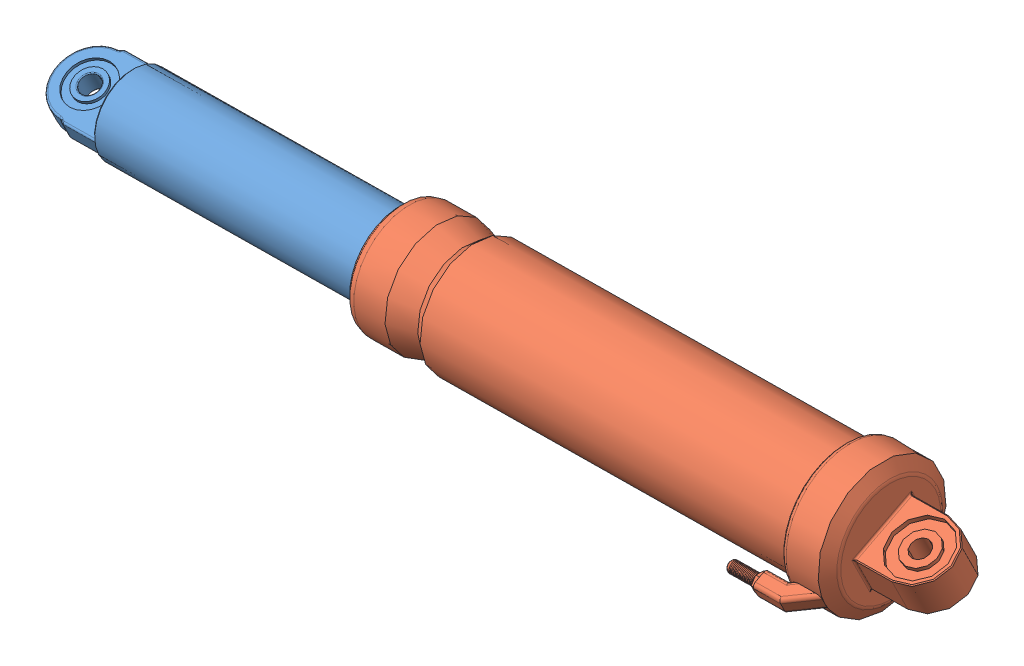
SolidWorks assembly MAE 480 Shock.SLDASM, configuration Default (file format 8000). Lengths in mm.
Overall size (480.92 98.86 104.39).
2 component instances, 2 part files, 3 mates.
Components (placement in the parent):
- MAE 480 Bottom shock-2: MAE 480 Bottom shock.SLDPRT [Default] at (1010.6602 642.9297 65.0814) x (0.008727 -0.446181 0.8949) z (-0.999962 -0.003894 0.00781) size (42.13 42.13 383.22)
- MAE 480 shock top-2: MAE 480 shock top.SLDPRT [Default] at (1143.595 643.4473 64.0432) x (-0.008727 0.446181 -0.8949) z (0.999962 0.003894 -0.00781) size (79.31 69.62 302.16)
Mates (geometry in assembly coordinates):
- Concentric1: concentric aligned: cylinder of MAE 480 Bottom shock-2 through (837.9467 642.2571 66.4303) axis (0.999962 0.003894 -0.00781) radius 21.065; cylinder of MAE 480 shock top-2 through (978.3674 642.8039 65.3336) axis (0.999962 0.003894 -0.00781) radius 30
- Parallel2: parallel aligned: plane of MAE 480 Bottom shock-2 through (820.0632 654.7054 53.7893) normal (0 0.894934 0.446198); plane of MAE 480 shock top-2 through (1263.3705 652.863 67.5697) normal (0 0.894934 0.446198)
- LimitDistance1: limit distance = 25 mm anti-aligned: plane of MAE 480 Bottom shock-2 through (1183.3736 643.6022 63.7325) normal (0.999962 0.003894 -0.00781); plane of MAE 480 shock top-2 through (1208.1806 653.5155 43.8495) normal (-0.999962 -0.003894 0.00781)
